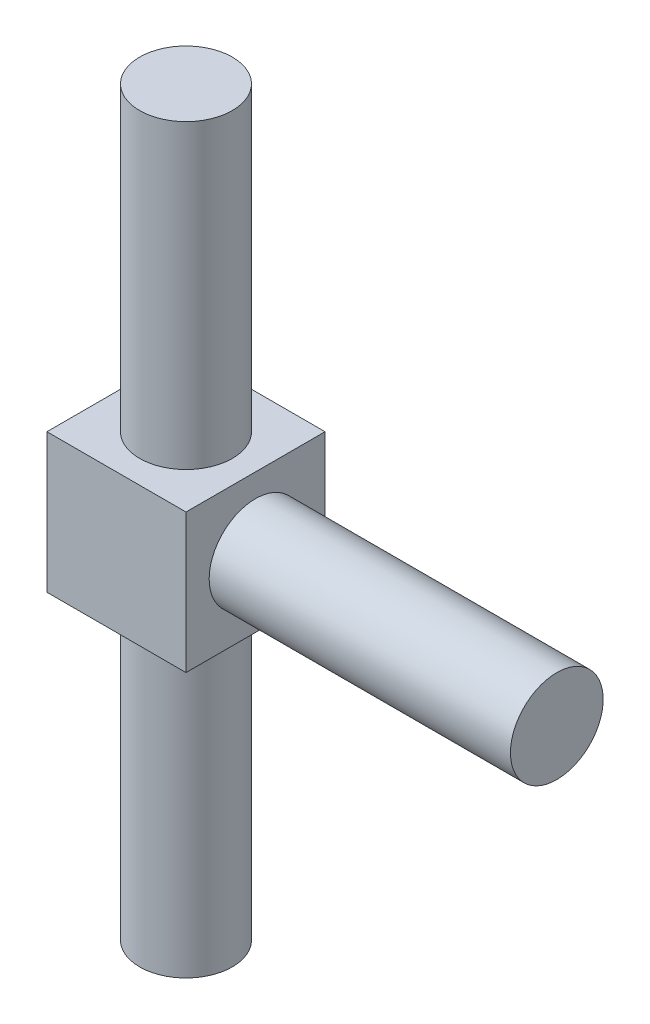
ISO-10303-21;
HEADER;
FILE_DESCRIPTION(('STEP AP214'),'2;1');
FILE_NAME('part.step','',(''),(''),'','','');
FILE_SCHEMA(('AUTOMOTIVE_DESIGN { 1 0 10303 214 1 1 1 1 }'));
ENDSEC;
DATA;
#1=APPLICATION_CONTEXT('core data for automotive mechanical design processes');
#2=APPLICATION_PROTOCOL_DEFINITION('international standard','automotive_design',2000,#1);
#3=PRODUCT_CONTEXT('',#1,'mechanical');
#4=PRODUCT('Part','Part','',(#3));
#5=PRODUCT_RELATED_PRODUCT_CATEGORY('part','',(#4));
#6=PRODUCT_DEFINITION_FORMATION('','',#4);
#7=PRODUCT_DEFINITION_CONTEXT('part definition',#1,'design');
#8=PRODUCT_DEFINITION('design','',#6,#7);
#9=PRODUCT_DEFINITION_SHAPE('','',#8);
#10=(LENGTH_UNIT() NAMED_UNIT(*) SI_UNIT(.MILLI.,.METRE.));
#11=(NAMED_UNIT(*) PLANE_ANGLE_UNIT() SI_UNIT($,.RADIAN.));
#12=(NAMED_UNIT(*) SI_UNIT($,.STERADIAN.) SOLID_ANGLE_UNIT());
#13=UNCERTAINTY_MEASURE_WITH_UNIT(LENGTH_MEASURE(1.E-05),#10,'distance_accuracy_value','');
#14=(GEOMETRIC_REPRESENTATION_CONTEXT(3) GLOBAL_UNCERTAINTY_ASSIGNED_CONTEXT((#13)) GLOBAL_UNIT_ASSIGNED_CONTEXT((#10,
#11,#12)) REPRESENTATION_CONTEXT('',''));
#15=CARTESIAN_POINT('',(0.,0.,0.));
#16=DIRECTION('',(0.,0.,1.));
#17=DIRECTION('',(1.,0.,0.));
#18=AXIS2_PLACEMENT_3D('',#15,#16,#17);
#19=CARTESIAN_POINT('',(0.,6.,0.));
#20=DIRECTION('',(1.,0.,0.));
#21=DIRECTION('',(0.,0.,-1.));
#22=AXIS2_PLACEMENT_3D('',#19,#20,#21);
#23=PLANE('',#22);
#24=DIRECTION('',(0.,0.,1.));
#25=VECTOR('',#24,1.);
#26=CARTESIAN_POINT('',(0.,0.,0.));
#27=LINE('',#26,#25);
#28=CARTESIAN_POINT('',(0.,0.,-6.));
#29=VERTEX_POINT('',#28);
#30=CARTESIAN_POINT('',(0.,0.,0.));
#31=VERTEX_POINT('',#30);
#32=EDGE_CURVE('E110',#29,#31,#27,.T.);
#33=ORIENTED_EDGE('',*,*,#32,.T.);
#34=DIRECTION('',(0.,-1.,0.));
#35=VECTOR('',#34,1.);
#36=CARTESIAN_POINT('',(0.,6.,0.));
#37=LINE('',#36,#35);
#38=CARTESIAN_POINT('',(0.,6.,0.));
#39=VERTEX_POINT('',#38);
#40=EDGE_CURVE('E46',#39,#31,#37,.T.);
#41=ORIENTED_EDGE('',*,*,#40,.F.);
#42=DIRECTION('',(0.,0.,1.));
#43=VECTOR('',#42,1.);
#44=CARTESIAN_POINT('',(0.,6.,0.));
#45=LINE('',#44,#43);
#46=CARTESIAN_POINT('',(0.,6.,-6.));
#47=VERTEX_POINT('',#46);
#48=EDGE_CURVE('E97',#47,#39,#45,.T.);
#49=ORIENTED_EDGE('',*,*,#48,.F.);
#50=DIRECTION('',(0.,-1.,0.));
#51=VECTOR('',#50,1.);
#52=CARTESIAN_POINT('',(0.,6.,-6.));
#53=LINE('',#52,#51);
#54=EDGE_CURVE('E106',#47,#29,#53,.T.);
#55=ORIENTED_EDGE('',*,*,#54,.T.);
#56=EDGE_LOOP('',(#33,#41,#49,#55));
#57=FACE_BOUND('',#56,.T.);
#58=ADVANCED_FACE('F43',(#57),#23,.F.);
#59=CARTESIAN_POINT('',(0.,6.,0.));
#60=DIRECTION('',(0.,0.,-1.));
#61=DIRECTION('',(-1.,0.,0.));
#62=AXIS2_PLACEMENT_3D('',#59,#60,#61);
#63=PLANE('',#62);
#64=DIRECTION('',(1.,0.,0.));
#65=VECTOR('',#64,1.);
#66=CARTESIAN_POINT('',(0.,0.,0.));
#67=LINE('',#66,#65);
#68=CARTESIAN_POINT('',(6.,0.,0.));
#69=VERTEX_POINT('',#68);
#70=EDGE_CURVE('E102',#31,#69,#67,.T.);
#71=ORIENTED_EDGE('',*,*,#70,.T.);
#72=DIRECTION('',(0.,-1.,0.));
#73=VECTOR('',#72,1.);
#74=CARTESIAN_POINT('',(6.,6.,0.));
#75=LINE('',#74,#73);
#76=CARTESIAN_POINT('',(6.,6.,0.));
#77=VERTEX_POINT('',#76);
#78=EDGE_CURVE('E100',#77,#69,#75,.T.);
#79=ORIENTED_EDGE('',*,*,#78,.F.);
#80=DIRECTION('',(1.,0.,0.));
#81=VECTOR('',#80,1.);
#82=CARTESIAN_POINT('',(0.,6.,0.));
#83=LINE('',#82,#81);
#84=EDGE_CURVE('E92',#39,#77,#83,.T.);
#85=ORIENTED_EDGE('',*,*,#84,.F.);
#86=ORIENTED_EDGE('',*,*,#40,.T.);
#87=EDGE_LOOP('',(#71,#79,#85,#86));
#88=FACE_BOUND('',#87,.T.);
#89=ADVANCED_FACE('F101',(#88),#63,.F.);
#90=CARTESIAN_POINT('',(6.,6.,0.));
#91=DIRECTION('',(-1.,0.,0.));
#92=DIRECTION('',(0.,0.,1.));
#93=AXIS2_PLACEMENT_3D('',#90,#91,#92);
#94=PLANE('',#93);
#95=CARTESIAN_POINT('',(6.,3.,-3.));
#96=DIRECTION('',(1.,0.,0.));
#97=DIRECTION('',(0.,0.,-1.));
#98=AXIS2_PLACEMENT_3D('',#95,#96,#97);
#99=CIRCLE('',#98,2.);
#100=CARTESIAN_POINT('',(6.,3.,-1.));
#101=VERTEX_POINT('',#100);
#102=EDGE_CURVE('E11',#101,#101,#99,.T.);
#103=ORIENTED_EDGE('',*,*,#102,.F.);
#104=EDGE_LOOP('',(#103));
#105=FACE_BOUND('',#104,.T.);
#106=DIRECTION('',(0.,0.,-1.));
#107=VECTOR('',#106,1.);
#108=CARTESIAN_POINT('',(6.,0.,0.));
#109=LINE('',#108,#107);
#110=CARTESIAN_POINT('',(6.,0.,-6.));
#111=VERTEX_POINT('',#110);
#112=EDGE_CURVE('E78',#69,#111,#109,.T.);
#113=ORIENTED_EDGE('',*,*,#112,.T.);
#114=DIRECTION('',(0.,-1.,0.));
#115=VECTOR('',#114,1.);
#116=CARTESIAN_POINT('',(6.,6.,-6.));
#117=LINE('',#116,#115);
#118=CARTESIAN_POINT('',(6.,6.,-6.));
#119=VERTEX_POINT('',#118);
#120=EDGE_CURVE('E103',#119,#111,#117,.T.);
#121=ORIENTED_EDGE('',*,*,#120,.F.);
#122=DIRECTION('',(0.,0.,-1.));
#123=VECTOR('',#122,1.);
#124=CARTESIAN_POINT('',(6.,6.,0.));
#125=LINE('',#124,#123);
#126=EDGE_CURVE('E95',#77,#119,#125,.T.);
#127=ORIENTED_EDGE('',*,*,#126,.F.);
#128=ORIENTED_EDGE('',*,*,#78,.T.);
#129=EDGE_LOOP('',(#113,#121,#127,#128));
#130=FACE_BOUND('',#129,.T.);
#131=ADVANCED_FACE('F104',(#105,#130),#94,.F.);
#132=CARTESIAN_POINT('',(0.,6.,-6.));
#133=DIRECTION('',(0.,0.,1.));
#134=DIRECTION('',(1.,0.,0.));
#135=AXIS2_PLACEMENT_3D('',#132,#133,#134);
#136=PLANE('',#135);
#137=DIRECTION('',(-1.,0.,0.));
#138=VECTOR('',#137,1.);
#139=CARTESIAN_POINT('',(0.,0.,-6.));
#140=LINE('',#139,#138);
#141=EDGE_CURVE('E84',#111,#29,#140,.T.);
#142=ORIENTED_EDGE('',*,*,#141,.T.);
#143=ORIENTED_EDGE('',*,*,#54,.F.);
#144=DIRECTION('',(-1.,0.,0.));
#145=VECTOR('',#144,1.);
#146=CARTESIAN_POINT('',(0.,6.,-6.));
#147=LINE('',#146,#145);
#148=EDGE_CURVE('E61',#119,#47,#147,.T.);
#149=ORIENTED_EDGE('',*,*,#148,.F.);
#150=ORIENTED_EDGE('',*,*,#120,.T.);
#151=EDGE_LOOP('',(#142,#143,#149,#150));
#152=FACE_BOUND('',#151,.T.);
#153=ADVANCED_FACE('F118',(#152),#136,.F.);
#154=CARTESIAN_POINT('',(0.,6.,0.));
#155=DIRECTION('',(0.,-1.,0.));
#156=DIRECTION('',(0.,0.,-1.));
#157=AXIS2_PLACEMENT_3D('',#154,#155,#156);
#158=PLANE('',#157);
#159=CARTESIAN_POINT('',(3.,6.,-3.));
#160=DIRECTION('',(0.,1.,0.));
#161=DIRECTION('',(0.,0.,1.));
#162=AXIS2_PLACEMENT_3D('',#159,#160,#161);
#163=CIRCLE('',#162,2.);
#164=CARTESIAN_POINT('',(3.,6.,-5.));
#165=VERTEX_POINT('',#164);
#166=EDGE_CURVE('E124',#165,#165,#163,.T.);
#167=ORIENTED_EDGE('',*,*,#166,.F.);
#168=EDGE_LOOP('',(#167));
#169=FACE_BOUND('',#168,.T.);
#170=ORIENTED_EDGE('',*,*,#48,.T.);
#171=ORIENTED_EDGE('',*,*,#84,.T.);
#172=ORIENTED_EDGE('',*,*,#126,.T.);
#173=ORIENTED_EDGE('',*,*,#148,.T.);
#174=EDGE_LOOP('',(#170,#171,#172,#173));
#175=FACE_BOUND('',#174,.T.);
#176=ADVANCED_FACE('F93',(#169,#175),#158,.F.);
#177=CARTESIAN_POINT('',(0.,0.,0.));
#178=DIRECTION('',(0.,-1.,0.));
#179=DIRECTION('',(0.,0.,-1.));
#180=AXIS2_PLACEMENT_3D('',#177,#178,#179);
#181=PLANE('',#180);
#182=CARTESIAN_POINT('',(3.,0.,-3.));
#183=DIRECTION('',(0.,-1.,0.));
#184=DIRECTION('',(0.,0.,-1.));
#185=AXIS2_PLACEMENT_3D('',#182,#183,#184);
#186=CIRCLE('',#185,2.);
#187=CARTESIAN_POINT('',(3.,0.,-0.999999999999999));
#188=VERTEX_POINT('',#187);
#189=EDGE_CURVE('E52',#188,#188,#186,.T.);
#190=ORIENTED_EDGE('',*,*,#189,.F.);
#191=EDGE_LOOP('',(#190));
#192=FACE_BOUND('',#191,.T.);
#193=ORIENTED_EDGE('',*,*,#32,.F.);
#194=ORIENTED_EDGE('',*,*,#141,.F.);
#195=ORIENTED_EDGE('',*,*,#112,.F.);
#196=ORIENTED_EDGE('',*,*,#70,.F.);
#197=EDGE_LOOP('',(#193,#194,#195,#196));
#198=FACE_BOUND('',#197,.T.);
#199=ADVANCED_FACE('F121',(#192,#198),#181,.T.);
#200=CARTESIAN_POINT('',(3.,19.,-3.));
#201=DIRECTION('',(0.,-1.,0.));
#202=DIRECTION('',(0.,0.,-1.));
#203=AXIS2_PLACEMENT_3D('',#200,#201,#202);
#204=CYLINDRICAL_SURFACE('',#203,2.);
#205=CARTESIAN_POINT('',(3.,19.,-3.));
#206=DIRECTION('',(0.,1.,0.));
#207=DIRECTION('',(0.,0.,1.));
#208=AXIS2_PLACEMENT_3D('',#205,#206,#207);
#209=CIRCLE('',#208,2.);
#210=CARTESIAN_POINT('',(3.,19.,-5.));
#211=VERTEX_POINT('',#210);
#212=EDGE_CURVE('E113',#211,#211,#209,.T.);
#213=CARTESIAN_POINT('',(3.,19.,-5.));
#214=CARTESIAN_POINT('',(3.,18.8645833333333,-5.));
#215=CARTESIAN_POINT('',(3.,18.7291666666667,-5.));
#216=CARTESIAN_POINT('',(3.,18.4583333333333,-5.));
#217=CARTESIAN_POINT('',(3.,18.3229166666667,-5.));
#218=CARTESIAN_POINT('',(3.,18.0520833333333,-5.));
#219=CARTESIAN_POINT('',(3.,17.9166666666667,-5.));
#220=CARTESIAN_POINT('',(3.,17.6458333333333,-5.));
#221=CARTESIAN_POINT('',(3.,17.5104166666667,-5.));
#222=CARTESIAN_POINT('',(3.,17.2395833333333,-5.));
#223=CARTESIAN_POINT('',(3.,17.1041666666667,-5.));
#224=CARTESIAN_POINT('',(3.,16.8333333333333,-5.));
#225=CARTESIAN_POINT('',(3.,16.6979166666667,-5.));
#226=CARTESIAN_POINT('',(3.,16.4270833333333,-5.));
#227=CARTESIAN_POINT('',(3.,16.2916666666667,-5.));
#228=CARTESIAN_POINT('',(3.,16.0208333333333,-5.));
#229=CARTESIAN_POINT('',(3.,15.8854166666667,-5.));
#230=CARTESIAN_POINT('',(3.,15.6145833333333,-5.));
#231=CARTESIAN_POINT('',(3.,15.4791666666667,-5.));
#232=CARTESIAN_POINT('',(3.,15.2083333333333,-5.));
#233=CARTESIAN_POINT('',(3.,15.0729166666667,-5.));
#234=CARTESIAN_POINT('',(3.,14.8020833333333,-5.));
#235=CARTESIAN_POINT('',(3.,14.6666666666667,-5.));
#236=CARTESIAN_POINT('',(3.,14.3958333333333,-5.));
#237=CARTESIAN_POINT('',(3.,14.2604166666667,-5.));
#238=CARTESIAN_POINT('',(3.,13.9895833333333,-5.));
#239=CARTESIAN_POINT('',(3.,13.8541666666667,-5.));
#240=CARTESIAN_POINT('',(3.,13.5833333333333,-5.));
#241=CARTESIAN_POINT('',(3.,13.4479166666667,-5.));
#242=CARTESIAN_POINT('',(3.,13.1770833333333,-5.));
#243=CARTESIAN_POINT('',(3.,13.0416666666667,-5.));
#244=CARTESIAN_POINT('',(3.,12.7708333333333,-5.));
#245=CARTESIAN_POINT('',(3.,12.6354166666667,-5.));
#246=CARTESIAN_POINT('',(3.,12.3645833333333,-5.));
#247=CARTESIAN_POINT('',(3.,12.2291666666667,-5.));
#248=CARTESIAN_POINT('',(3.,11.9583333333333,-5.));
#249=CARTESIAN_POINT('',(3.,11.8229166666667,-5.));
#250=CARTESIAN_POINT('',(3.,11.5520833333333,-5.));
#251=CARTESIAN_POINT('',(3.,11.4166666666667,-5.));
#252=CARTESIAN_POINT('',(3.,11.1458333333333,-5.));
#253=CARTESIAN_POINT('',(3.,11.0104166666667,-5.));
#254=CARTESIAN_POINT('',(3.,10.7395833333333,-5.));
#255=CARTESIAN_POINT('',(3.,10.6041666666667,-5.));
#256=CARTESIAN_POINT('',(3.,10.3333333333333,-5.));
#257=CARTESIAN_POINT('',(3.,10.1979166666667,-5.));
#258=CARTESIAN_POINT('',(3.,9.92708333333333,-5.));
#259=CARTESIAN_POINT('',(3.,9.79166666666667,-5.));
#260=CARTESIAN_POINT('',(3.,9.52083333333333,-5.));
#261=CARTESIAN_POINT('',(3.,9.38541666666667,-5.));
#262=CARTESIAN_POINT('',(3.,9.11458333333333,-5.));
#263=CARTESIAN_POINT('',(3.,8.97916666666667,-5.));
#264=CARTESIAN_POINT('',(3.,8.70833333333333,-5.));
#265=CARTESIAN_POINT('',(3.,8.57291666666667,-5.));
#266=CARTESIAN_POINT('',(3.,8.30208333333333,-5.));
#267=CARTESIAN_POINT('',(3.,8.16666666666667,-5.));
#268=CARTESIAN_POINT('',(3.,7.89583333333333,-5.));
#269=CARTESIAN_POINT('',(3.,7.76041666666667,-5.));
#270=CARTESIAN_POINT('',(3.,7.48958333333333,-5.));
#271=CARTESIAN_POINT('',(3.,7.35416666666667,-5.));
#272=CARTESIAN_POINT('',(3.,7.08333333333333,-5.));
#273=CARTESIAN_POINT('',(3.,6.94791666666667,-5.));
#274=CARTESIAN_POINT('',(3.,6.67708333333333,-5.));
#275=CARTESIAN_POINT('',(3.,6.54166666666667,-5.));
#276=CARTESIAN_POINT('',(3.,6.27083333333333,-5.));
#277=CARTESIAN_POINT('',(3.,6.13541666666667,-5.));
#278=CARTESIAN_POINT('',(3.,6.,-5.));
#279=B_SPLINE_CURVE_WITH_KNOTS('',3,(#213,#214,#215,#216,#217,#218,#219,#220,#221,#222,#223,
#224,#225,#226,#227,#228,#229,#230,#231,#232,#233,#234,#235,#236,#237,#238,#239,#240,#241,#242,
#243,#244,#245,#246,#247,#248,#249,#250,#251,#252,#253,#254,#255,#256,#257,#258,#259,#260,#261,
#262,#263,#264,#265,#266,#267,#268,#269,#270,#271,#272,#273,#274,#275,#276,#277,#278),
.UNSPECIFIED.,.F.,.F.,(4,2,2,2,2,2,2,2,2,2,2,2,2,2,2,2,2,2,2,2,2,2,2,2,2,2,2,2,2,2,2,2,4),(0.,
0.406249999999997,0.812499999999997,1.21875,1.625,2.03125,2.4375,2.84375,3.25,3.65625,4.0625,
4.46875,4.875,5.28125,5.6875,6.09375,6.5,6.90625,7.3125,7.71875,8.125,8.53124999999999,8.9375,
9.34375,9.75,10.15625,10.5625,10.96875,11.375,11.78125,12.1875,12.59375,13.),.UNSPECIFIED.);
#280=EDGE_CURVE('BSEAM181',#211,#165,#279,.T.);
#281=ORIENTED_EDGE('',*,*,#212,.F.);
#282=ORIENTED_EDGE('',*,*,#166,.T.);
#283=ORIENTED_EDGE('',*,*,#280,.T.);
#284=ORIENTED_EDGE('',*,*,#280,.F.);
#285=EDGE_LOOP('',(#281,#283,#282,#284));
#286=FACE_BOUND('',#285,.T.);
#287=ADVANCED_FACE('F181',(#286),#204,.T.);
#288=CARTESIAN_POINT('',(3.,19.,-3.));
#289=DIRECTION('',(0.,1.,0.));
#290=DIRECTION('',(0.,0.,1.));
#291=AXIS2_PLACEMENT_3D('',#288,#289,#290);
#292=PLANE('',#291);
#293=ORIENTED_EDGE('',*,*,#212,.T.);
#294=EDGE_LOOP('',(#293));
#295=FACE_BOUND('',#294,.T.);
#296=ADVANCED_FACE('F185',(#295),#292,.T.);
#297=CARTESIAN_POINT('',(3.,-13.,-3.));
#298=DIRECTION('',(0.,1.,0.));
#299=DIRECTION('',(0.,0.,1.));
#300=AXIS2_PLACEMENT_3D('',#297,#298,#299);
#301=CYLINDRICAL_SURFACE('',#300,2.);
#302=CARTESIAN_POINT('',(3.,-13.,-3.));
#303=DIRECTION('',(0.,-1.,0.));
#304=DIRECTION('',(0.,0.,-1.));
#305=AXIS2_PLACEMENT_3D('',#302,#303,#304);
#306=CIRCLE('',#305,2.);
#307=CARTESIAN_POINT('',(3.,-13.,-0.999999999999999));
#308=VERTEX_POINT('',#307);
#309=EDGE_CURVE('E129',#308,#308,#306,.T.);
#310=CARTESIAN_POINT('',(3.,-13.,-0.999999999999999));
#311=CARTESIAN_POINT('',(3.,-12.8645833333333,-0.999999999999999));
#312=CARTESIAN_POINT('',(3.,-12.7291666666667,-0.999999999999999));
#313=CARTESIAN_POINT('',(3.,-12.4583333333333,-0.999999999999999));
#314=CARTESIAN_POINT('',(3.,-12.3229166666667,-0.999999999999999));
#315=CARTESIAN_POINT('',(3.,-12.0520833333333,-0.999999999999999));
#316=CARTESIAN_POINT('',(3.,-11.9166666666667,-0.999999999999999));
#317=CARTESIAN_POINT('',(3.,-11.6458333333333,-0.999999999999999));
#318=CARTESIAN_POINT('',(3.,-11.5104166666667,-0.999999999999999));
#319=CARTESIAN_POINT('',(3.,-11.2395833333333,-0.999999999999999));
#320=CARTESIAN_POINT('',(3.,-11.1041666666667,-0.999999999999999));
#321=CARTESIAN_POINT('',(3.,-10.8333333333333,-0.999999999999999));
#322=CARTESIAN_POINT('',(3.,-10.6979166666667,-0.999999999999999));
#323=CARTESIAN_POINT('',(3.,-10.4270833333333,-0.999999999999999));
#324=CARTESIAN_POINT('',(3.,-10.2916666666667,-0.999999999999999));
#325=CARTESIAN_POINT('',(3.,-10.0208333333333,-0.999999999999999));
#326=CARTESIAN_POINT('',(3.,-9.88541666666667,-0.999999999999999));
#327=CARTESIAN_POINT('',(3.,-9.61458333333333,-0.999999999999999));
#328=CARTESIAN_POINT('',(3.,-9.47916666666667,-0.999999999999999));
#329=CARTESIAN_POINT('',(3.,-9.20833333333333,-0.999999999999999));
#330=CARTESIAN_POINT('',(3.,-9.07291666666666,-0.999999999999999));
#331=CARTESIAN_POINT('',(3.,-8.80208333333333,-0.999999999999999));
#332=CARTESIAN_POINT('',(3.,-8.66666666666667,-0.999999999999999));
#333=CARTESIAN_POINT('',(3.,-8.39583333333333,-0.999999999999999));
#334=CARTESIAN_POINT('',(3.,-8.26041666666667,-0.999999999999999));
#335=CARTESIAN_POINT('',(3.,-7.98958333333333,-0.999999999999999));
#336=CARTESIAN_POINT('',(3.,-7.85416666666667,-0.999999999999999));
#337=CARTESIAN_POINT('',(3.,-7.58333333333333,-0.999999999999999));
#338=CARTESIAN_POINT('',(3.,-7.44791666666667,-0.999999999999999));
#339=CARTESIAN_POINT('',(3.,-7.17708333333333,-0.999999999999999));
#340=CARTESIAN_POINT('',(3.,-7.04166666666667,-0.999999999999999));
#341=CARTESIAN_POINT('',(3.,-6.77083333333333,-0.999999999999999));
#342=CARTESIAN_POINT('',(3.,-6.63541666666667,-0.999999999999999));
#343=CARTESIAN_POINT('',(3.,-6.36458333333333,-0.999999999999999));
#344=CARTESIAN_POINT('',(3.,-6.22916666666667,-0.999999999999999));
#345=CARTESIAN_POINT('',(3.,-5.95833333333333,-0.999999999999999));
#346=CARTESIAN_POINT('',(3.,-5.82291666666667,-0.999999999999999));
#347=CARTESIAN_POINT('',(3.,-5.55208333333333,-0.999999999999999));
#348=CARTESIAN_POINT('',(3.,-5.41666666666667,-0.999999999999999));
#349=CARTESIAN_POINT('',(3.,-5.14583333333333,-0.999999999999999));
#350=CARTESIAN_POINT('',(3.,-5.01041666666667,-0.999999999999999));
#351=CARTESIAN_POINT('',(3.,-4.73958333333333,-0.999999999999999));
#352=CARTESIAN_POINT('',(3.,-4.60416666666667,-0.999999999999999));
#353=CARTESIAN_POINT('',(3.,-4.33333333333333,-0.999999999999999));
#354=CARTESIAN_POINT('',(3.,-4.19791666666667,-0.999999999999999));
#355=CARTESIAN_POINT('',(3.,-3.92708333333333,-0.999999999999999));
#356=CARTESIAN_POINT('',(3.,-3.79166666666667,-0.999999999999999));
#357=CARTESIAN_POINT('',(3.,-3.52083333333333,-0.999999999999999));
#358=CARTESIAN_POINT('',(3.,-3.38541666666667,-0.999999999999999));
#359=CARTESIAN_POINT('',(3.,-3.11458333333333,-0.999999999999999));
#360=CARTESIAN_POINT('',(3.,-2.97916666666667,-0.999999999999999));
#361=CARTESIAN_POINT('',(3.,-2.70833333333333,-0.999999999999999));
#362=CARTESIAN_POINT('',(3.,-2.57291666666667,-0.999999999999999));
#363=CARTESIAN_POINT('',(3.,-2.30208333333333,-0.999999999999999));
#364=CARTESIAN_POINT('',(3.,-2.16666666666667,-0.999999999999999));
#365=CARTESIAN_POINT('',(3.,-1.89583333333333,-0.999999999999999));
#366=CARTESIAN_POINT('',(3.,-1.76041666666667,-0.999999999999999));
#367=CARTESIAN_POINT('',(3.,-1.48958333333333,-0.999999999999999));
#368=CARTESIAN_POINT('',(3.,-1.35416666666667,-0.999999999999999));
#369=CARTESIAN_POINT('',(3.,-1.08333333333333,-0.999999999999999));
#370=CARTESIAN_POINT('',(3.,-0.947916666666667,-0.999999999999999));
#371=CARTESIAN_POINT('',(3.,-0.677083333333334,-0.999999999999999));
#372=CARTESIAN_POINT('',(3.,-0.541666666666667,-0.999999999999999));
#373=CARTESIAN_POINT('',(3.,-0.270833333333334,-0.999999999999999));
#374=CARTESIAN_POINT('',(3.,-0.135416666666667,-0.999999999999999));
#375=CARTESIAN_POINT('',(3.,0.,-0.999999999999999));
#376=B_SPLINE_CURVE_WITH_KNOTS('',3,(#310,#311,#312,#313,#314,#315,#316,#317,#318,#319,#320,
#321,#322,#323,#324,#325,#326,#327,#328,#329,#330,#331,#332,#333,#334,#335,#336,#337,#338,#339,
#340,#341,#342,#343,#344,#345,#346,#347,#348,#349,#350,#351,#352,#353,#354,#355,#356,#357,#358,
#359,#360,#361,#362,#363,#364,#365,#366,#367,#368,#369,#370,#371,#372,#373,#374,#375),
.UNSPECIFIED.,.F.,.F.,(4,2,2,2,2,2,2,2,2,2,2,2,2,2,2,2,2,2,2,2,2,2,2,2,2,2,2,2,2,2,2,2,4),(0.,
0.40625,0.812500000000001,1.21875,1.625,2.03125,2.4375,2.84375,3.25,3.65625,4.0625,4.46875,
4.875,5.28125,5.6875,6.09375,6.5,6.90625,7.3125,7.71875,8.125,8.53125,8.9375,9.34375,9.75,
10.15625,10.5625,10.96875,11.375,11.78125,12.1875,12.59375,13.),.UNSPECIFIED.);
#377=EDGE_CURVE('BSEAM194',#308,#188,#376,.T.);
#378=ORIENTED_EDGE('',*,*,#309,.F.);
#379=ORIENTED_EDGE('',*,*,#189,.T.);
#380=ORIENTED_EDGE('',*,*,#377,.T.);
#381=ORIENTED_EDGE('',*,*,#377,.F.);
#382=EDGE_LOOP('',(#378,#380,#379,#381));
#383=FACE_BOUND('',#382,.T.);
#384=ADVANCED_FACE('F194',(#383),#301,.T.);
#385=CARTESIAN_POINT('',(0.,-13.,0.));
#386=DIRECTION('',(0.,-1.,0.));
#387=DIRECTION('',(0.,0.,-1.));
#388=AXIS2_PLACEMENT_3D('',#385,#386,#387);
#389=PLANE('',#388);
#390=ORIENTED_EDGE('',*,*,#309,.T.);
#391=EDGE_LOOP('',(#390));
#392=FACE_BOUND('',#391,.T.);
#393=ADVANCED_FACE('F143',(#392),#389,.T.);
#394=CARTESIAN_POINT('',(19.,3.,-3.00000000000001));
#395=DIRECTION('',(-1.,0.,0.));
#396=DIRECTION('',(0.,0.,1.));
#397=AXIS2_PLACEMENT_3D('',#394,#395,#396);
#398=CYLINDRICAL_SURFACE('',#397,2.);
#399=CARTESIAN_POINT('',(19.,3.,-3.00000000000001));
#400=DIRECTION('',(1.,0.,0.));
#401=DIRECTION('',(0.,0.,-1.));
#402=AXIS2_PLACEMENT_3D('',#399,#400,#401);
#403=CIRCLE('',#402,2.);
#404=CARTESIAN_POINT('',(19.,3.,-1.00000000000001));
#405=VERTEX_POINT('',#404);
#406=EDGE_CURVE('E133',#405,#405,#403,.T.);
#407=CARTESIAN_POINT('',(19.,3.,-1.00000000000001));
#408=CARTESIAN_POINT('',(18.8645833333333,3.,-1.00000000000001));
#409=CARTESIAN_POINT('',(18.7291666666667,3.,-1.00000000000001));
#410=CARTESIAN_POINT('',(18.4583333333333,3.,-1.00000000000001));
#411=CARTESIAN_POINT('',(18.3229166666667,3.,-1.00000000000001));
#412=CARTESIAN_POINT('',(18.0520833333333,3.,-1.00000000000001));
#413=CARTESIAN_POINT('',(17.9166666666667,3.,-1.));
#414=CARTESIAN_POINT('',(17.6458333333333,3.,-1.));
#415=CARTESIAN_POINT('',(17.5104166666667,3.,-1.));
#416=CARTESIAN_POINT('',(17.2395833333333,3.,-1.));
#417=CARTESIAN_POINT('',(17.1041666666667,3.,-1.));
#418=CARTESIAN_POINT('',(16.8333333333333,3.,-1.));
#419=CARTESIAN_POINT('',(16.6979166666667,3.,-1.));
#420=CARTESIAN_POINT('',(16.4270833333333,3.,-1.));
#421=CARTESIAN_POINT('',(16.2916666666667,3.,-1.));
#422=CARTESIAN_POINT('',(16.0208333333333,3.,-1.));
#423=CARTESIAN_POINT('',(15.8854166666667,3.,-1.));
#424=CARTESIAN_POINT('',(15.6145833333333,3.,-1.));
#425=CARTESIAN_POINT('',(15.4791666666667,3.,-1.));
#426=CARTESIAN_POINT('',(15.2083333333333,3.,-1.));
#427=CARTESIAN_POINT('',(15.0729166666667,3.,-1.));
#428=CARTESIAN_POINT('',(14.8020833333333,3.,-1.));
#429=CARTESIAN_POINT('',(14.6666666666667,3.,-1.));
#430=CARTESIAN_POINT('',(14.3958333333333,3.,-1.));
#431=CARTESIAN_POINT('',(14.2604166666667,3.,-1.));
#432=CARTESIAN_POINT('',(13.9895833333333,3.,-1.));
#433=CARTESIAN_POINT('',(13.8541666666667,3.,-1.));
#434=CARTESIAN_POINT('',(13.5833333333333,3.,-1.));
#435=CARTESIAN_POINT('',(13.4479166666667,3.,-1.));
#436=CARTESIAN_POINT('',(13.1770833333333,3.,-1.));
#437=CARTESIAN_POINT('',(13.0416666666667,3.,-1.));
#438=CARTESIAN_POINT('',(12.7708333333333,3.,-1.));
#439=CARTESIAN_POINT('',(12.6354166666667,3.,-1.));
#440=CARTESIAN_POINT('',(12.3645833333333,3.,-1.));
#441=CARTESIAN_POINT('',(12.2291666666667,3.,-1.));
#442=CARTESIAN_POINT('',(11.9583333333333,3.,-1.));
#443=CARTESIAN_POINT('',(11.8229166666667,3.,-1.));
#444=CARTESIAN_POINT('',(11.5520833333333,3.,-1.));
#445=CARTESIAN_POINT('',(11.4166666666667,3.,-1.));
#446=CARTESIAN_POINT('',(11.1458333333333,3.,-1.));
#447=CARTESIAN_POINT('',(11.0104166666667,3.,-1.));
#448=CARTESIAN_POINT('',(10.7395833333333,3.,-1.));
#449=CARTESIAN_POINT('',(10.6041666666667,3.,-1.));
#450=CARTESIAN_POINT('',(10.3333333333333,3.,-1.));
#451=CARTESIAN_POINT('',(10.1979166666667,3.,-1.));
#452=CARTESIAN_POINT('',(9.92708333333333,3.,-1.));
#453=CARTESIAN_POINT('',(9.79166666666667,3.,-1.));
#454=CARTESIAN_POINT('',(9.52083333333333,3.,-1.));
#455=CARTESIAN_POINT('',(9.38541666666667,3.,-1.));
#456=CARTESIAN_POINT('',(9.11458333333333,3.,-1.));
#457=CARTESIAN_POINT('',(8.97916666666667,3.,-1.));
#458=CARTESIAN_POINT('',(8.70833333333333,3.,-1.));
#459=CARTESIAN_POINT('',(8.57291666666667,3.,-1.));
#460=CARTESIAN_POINT('',(8.30208333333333,3.,-1.));
#461=CARTESIAN_POINT('',(8.16666666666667,3.,-1.));
#462=CARTESIAN_POINT('',(7.89583333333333,3.,-1.));
#463=CARTESIAN_POINT('',(7.76041666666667,3.,-1.));
#464=CARTESIAN_POINT('',(7.48958333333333,3.,-1.));
#465=CARTESIAN_POINT('',(7.35416666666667,3.,-1.));
#466=CARTESIAN_POINT('',(7.08333333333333,3.,-1.));
#467=CARTESIAN_POINT('',(6.94791666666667,3.,-1.));
#468=CARTESIAN_POINT('',(6.67708333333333,3.,-1.));
#469=CARTESIAN_POINT('',(6.54166666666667,3.,-1.));
#470=CARTESIAN_POINT('',(6.27083333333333,3.,-1.));
#471=CARTESIAN_POINT('',(6.13541666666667,3.,-1.));
#472=CARTESIAN_POINT('',(6.,3.,-1.));
#473=B_SPLINE_CURVE_WITH_KNOTS('',3,(#407,#408,#409,#410,#411,#412,#413,#414,#415,#416,#417,
#418,#419,#420,#421,#422,#423,#424,#425,#426,#427,#428,#429,#430,#431,#432,#433,#434,#435,#436,
#437,#438,#439,#440,#441,#442,#443,#444,#445,#446,#447,#448,#449,#450,#451,#452,#453,#454,#455,
#456,#457,#458,#459,#460,#461,#462,#463,#464,#465,#466,#467,#468,#469,#470,#471,#472),
.UNSPECIFIED.,.F.,.F.,(4,2,2,2,2,2,2,2,2,2,2,2,2,2,2,2,2,2,2,2,2,2,2,2,2,2,2,2,2,2,2,2,4),(0.,
0.406249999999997,0.812499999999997,1.21875,1.625,2.03125,2.4375,2.84375,3.25,3.65625,4.0625,
4.46875,4.875,5.28125,5.6875,6.09375,6.5,6.90625,7.3125,7.71875,8.125,8.53125,8.9375,9.34375,
9.75,10.15625,10.5625,10.96875,11.375,11.78125,12.1875,12.59375,13.),.UNSPECIFIED.);
#474=EDGE_CURVE('BSEAM140',#405,#101,#473,.T.);
#475=ORIENTED_EDGE('',*,*,#406,.F.);
#476=ORIENTED_EDGE('',*,*,#102,.T.);
#477=ORIENTED_EDGE('',*,*,#474,.T.);
#478=ORIENTED_EDGE('',*,*,#474,.F.);
#479=EDGE_LOOP('',(#475,#477,#476,#478));
#480=FACE_BOUND('',#479,.T.);
#481=ADVANCED_FACE('F140',(#480),#398,.T.);
#482=CARTESIAN_POINT('',(19.,0.,0.));
#483=DIRECTION('',(1.,0.,0.));
#484=DIRECTION('',(0.,0.,-1.));
#485=AXIS2_PLACEMENT_3D('',#482,#483,#484);
#486=PLANE('',#485);
#487=ORIENTED_EDGE('',*,*,#406,.T.);
#488=EDGE_LOOP('',(#487));
#489=FACE_BOUND('',#488,.T.);
#490=ADVANCED_FACE('F138',(#489),#486,.T.);
#491=CLOSED_SHELL('',(#58,#89,#131,#153,#176,#199,#287,#296,#384,#393,#481,#490));
#492=MANIFOLD_SOLID_BREP('B2',#491);
#493=ADVANCED_BREP_SHAPE_REPRESENTATION('',(#18,#492),#14);
#494=SHAPE_DEFINITION_REPRESENTATION(#9,#493);
ENDSEC;
END-ISO-10303-21;
